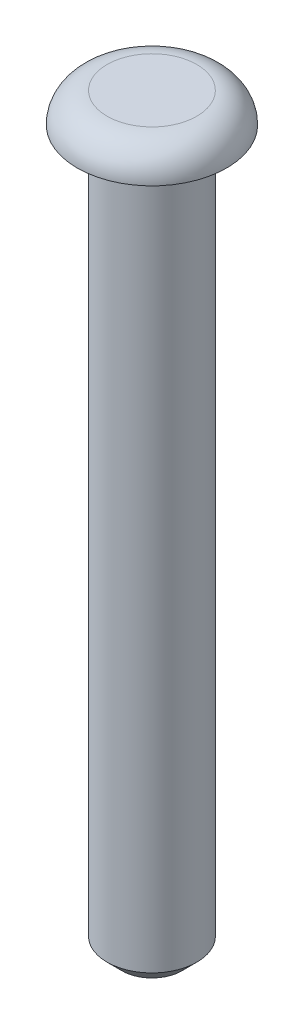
ISO-10303-21;
HEADER;
FILE_DESCRIPTION(('STEP AP214'),'2;1');
FILE_NAME('part.step','',(''),(''),'','','');
FILE_SCHEMA(('AUTOMOTIVE_DESIGN { 1 0 10303 214 1 1 1 1 }'));
ENDSEC;
DATA;
#1=APPLICATION_CONTEXT('core data for automotive mechanical design processes');
#2=APPLICATION_PROTOCOL_DEFINITION('international standard','automotive_design',2000,#1);
#3=PRODUCT_CONTEXT('',#1,'mechanical');
#4=PRODUCT('Part','Part','',(#3));
#5=PRODUCT_RELATED_PRODUCT_CATEGORY('part','',(#4));
#6=PRODUCT_DEFINITION_FORMATION('','',#4);
#7=PRODUCT_DEFINITION_CONTEXT('part definition',#1,'design');
#8=PRODUCT_DEFINITION('design','',#6,#7);
#9=PRODUCT_DEFINITION_SHAPE('','',#8);
#10=(LENGTH_UNIT() NAMED_UNIT(*) SI_UNIT(.MILLI.,.METRE.));
#11=(NAMED_UNIT(*) PLANE_ANGLE_UNIT() SI_UNIT($,.RADIAN.));
#12=(NAMED_UNIT(*) SI_UNIT($,.STERADIAN.) SOLID_ANGLE_UNIT());
#13=UNCERTAINTY_MEASURE_WITH_UNIT(LENGTH_MEASURE(1.E-05),#10,'distance_accuracy_value','');
#14=(GEOMETRIC_REPRESENTATION_CONTEXT(3) GLOBAL_UNCERTAINTY_ASSIGNED_CONTEXT((#13)) GLOBAL_UNIT_ASSIGNED_CONTEXT((#10,
#11,#12)) REPRESENTATION_CONTEXT('',''));
#15=CARTESIAN_POINT('',(0.,0.,0.));
#16=DIRECTION('',(0.,0.,1.));
#17=DIRECTION('',(1.,0.,0.));
#18=AXIS2_PLACEMENT_3D('',#15,#16,#17);
#19=CARTESIAN_POINT('',(0.,-38.1,0.));
#20=DIRECTION('',(0.,1.,0.));
#21=DIRECTION('',(0.,0.,1.));
#22=AXIS2_PLACEMENT_3D('',#19,#20,#21);
#23=CYLINDRICAL_SURFACE('',#22,2.38125);
#24=CARTESIAN_POINT('',(0.,-37.30625,0.));
#25=DIRECTION('',(0.,1.,0.));
#26=DIRECTION('',(0.,0.,1.));
#27=AXIS2_PLACEMENT_3D('',#24,#25,#26);
#28=CIRCLE('',#27,2.38125);
#29=CARTESIAN_POINT('',(0.,-37.30625,2.38125));
#30=VERTEX_POINT('',#29);
#31=EDGE_CURVE('E40',#30,#30,#28,.T.);
#32=CARTESIAN_POINT('',(0.,0.,0.));
#33=DIRECTION('',(0.,1.,0.));
#34=DIRECTION('',(0.,0.,1.));
#35=AXIS2_PLACEMENT_3D('',#32,#33,#34);
#36=CIRCLE('',#35,2.38125);
#37=CARTESIAN_POINT('',(0.,0.,2.38125));
#38=VERTEX_POINT('',#37);
#39=EDGE_CURVE('E48',#38,#38,#36,.T.);
#40=CARTESIAN_POINT('',(0.,-37.30625,2.38125));
#41=CARTESIAN_POINT('',(0.,-36.9176432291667,2.38125));
#42=CARTESIAN_POINT('',(0.,-36.5290364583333,2.38125));
#43=CARTESIAN_POINT('',(0.,-35.7518229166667,2.38125));
#44=CARTESIAN_POINT('',(0.,-35.3632161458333,2.38125));
#45=CARTESIAN_POINT('',(0.,-34.5860026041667,2.38125));
#46=CARTESIAN_POINT('',(0.,-34.1973958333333,2.38125));
#47=CARTESIAN_POINT('',(0.,-33.4201822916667,2.38125));
#48=CARTESIAN_POINT('',(0.,-33.0315755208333,2.38125));
#49=CARTESIAN_POINT('',(0.,-32.2543619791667,2.38125));
#50=CARTESIAN_POINT('',(0.,-31.8657552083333,2.38125));
#51=CARTESIAN_POINT('',(0.,-31.0885416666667,2.38125));
#52=CARTESIAN_POINT('',(0.,-30.6999348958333,2.38125));
#53=CARTESIAN_POINT('',(0.,-29.9227213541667,2.38125));
#54=CARTESIAN_POINT('',(0.,-29.5341145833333,2.38125));
#55=CARTESIAN_POINT('',(0.,-28.7569010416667,2.38125));
#56=CARTESIAN_POINT('',(0.,-28.3682942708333,2.38125));
#57=CARTESIAN_POINT('',(0.,-27.5910807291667,2.38125));
#58=CARTESIAN_POINT('',(0.,-27.2024739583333,2.38125));
#59=CARTESIAN_POINT('',(0.,-26.4252604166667,2.38125));
#60=CARTESIAN_POINT('',(0.,-26.0366536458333,2.38125));
#61=CARTESIAN_POINT('',(0.,-25.2594401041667,2.38125));
#62=CARTESIAN_POINT('',(0.,-24.8708333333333,2.38125));
#63=CARTESIAN_POINT('',(0.,-24.0936197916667,2.38125));
#64=CARTESIAN_POINT('',(0.,-23.7050130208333,2.38125));
#65=CARTESIAN_POINT('',(0.,-22.9277994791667,2.38125));
#66=CARTESIAN_POINT('',(0.,-22.5391927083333,2.38125));
#67=CARTESIAN_POINT('',(0.,-21.7619791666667,2.38125));
#68=CARTESIAN_POINT('',(0.,-21.3733723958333,2.38125));
#69=CARTESIAN_POINT('',(0.,-20.5961588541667,2.38125));
#70=CARTESIAN_POINT('',(0.,-20.2075520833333,2.38125));
#71=CARTESIAN_POINT('',(0.,-19.4303385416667,2.38125));
#72=CARTESIAN_POINT('',(0.,-19.0417317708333,2.38125));
#73=CARTESIAN_POINT('',(0.,-18.2645182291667,2.38125));
#74=CARTESIAN_POINT('',(0.,-17.8759114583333,2.38125));
#75=CARTESIAN_POINT('',(0.,-17.0986979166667,2.38125));
#76=CARTESIAN_POINT('',(0.,-16.7100911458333,2.38125));
#77=CARTESIAN_POINT('',(0.,-15.9328776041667,2.38125));
#78=CARTESIAN_POINT('',(0.,-15.5442708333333,2.38125));
#79=CARTESIAN_POINT('',(0.,-14.7670572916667,2.38125));
#80=CARTESIAN_POINT('',(0.,-14.3784505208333,2.38125));
#81=CARTESIAN_POINT('',(0.,-13.6012369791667,2.38125));
#82=CARTESIAN_POINT('',(0.,-13.2126302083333,2.38125));
#83=CARTESIAN_POINT('',(0.,-12.4354166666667,2.38125));
#84=CARTESIAN_POINT('',(0.,-12.0468098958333,2.38125));
#85=CARTESIAN_POINT('',(0.,-11.2695963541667,2.38125));
#86=CARTESIAN_POINT('',(0.,-10.8809895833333,2.38125));
#87=CARTESIAN_POINT('',(0.,-10.1037760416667,2.38125));
#88=CARTESIAN_POINT('',(0.,-9.71516927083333,2.38125));
#89=CARTESIAN_POINT('',(0.,-8.93795572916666,2.38125));
#90=CARTESIAN_POINT('',(0.,-8.54934895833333,2.38125));
#91=CARTESIAN_POINT('',(0.,-7.77213541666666,2.38125));
#92=CARTESIAN_POINT('',(0.,-7.38352864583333,2.38125));
#93=CARTESIAN_POINT('',(0.,-6.60631510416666,2.38125));
#94=CARTESIAN_POINT('',(0.,-6.21770833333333,2.38125));
#95=CARTESIAN_POINT('',(0.,-5.44049479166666,2.38125));
#96=CARTESIAN_POINT('',(0.,-5.05188802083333,2.38125));
#97=CARTESIAN_POINT('',(0.,-4.27467447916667,2.38125));
#98=CARTESIAN_POINT('',(0.,-3.88606770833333,2.38125));
#99=CARTESIAN_POINT('',(0.,-3.10885416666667,2.38125));
#100=CARTESIAN_POINT('',(0.,-2.72024739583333,2.38125));
#101=CARTESIAN_POINT('',(0.,-1.94303385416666,2.38125));
#102=CARTESIAN_POINT('',(0.,-1.55442708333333,2.38125));
#103=CARTESIAN_POINT('',(0.,-0.777213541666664,2.38125));
#104=CARTESIAN_POINT('',(0.,-0.388606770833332,2.38125));
#105=CARTESIAN_POINT('',(0.,0.,2.38125));
#106=B_SPLINE_CURVE_WITH_KNOTS('',3,(#40,#41,#42,#43,#44,#45,#46,#47,#48,#49,#50,#51,#52,#53,
#54,#55,#56,#57,#58,#59,#60,#61,#62,#63,#64,#65,#66,#67,#68,#69,#70,#71,#72,#73,#74,#75,#76,#77,
#78,#79,#80,#81,#82,#83,#84,#85,#86,#87,#88,#89,#90,#91,#92,#93,#94,#95,#96,#97,#98,#99,#100,
#101,#102,#103,#104,#105),.UNSPECIFIED.,.F.,.F.,(4,2,2,2,2,2,2,2,2,2,2,2,2,2,2,2,2,2,2,2,2,2,2,
2,2,2,2,2,2,2,2,2,4),(0.,1.1658203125,2.33164062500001,3.4974609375,4.66328125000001,
5.8291015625,6.994921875,8.1607421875,9.3265625,10.4923828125,11.658203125,12.8240234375,
13.98984375,15.1556640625,16.321484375,17.4873046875,18.653125,19.8189453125,20.984765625,
22.1505859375,23.31640625,24.4822265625,25.648046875,26.8138671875,27.9796875,29.1455078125,
30.311328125,31.4771484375,32.64296875,33.8087890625,34.974609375,36.1404296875,37.30625),.UNSPECIFIED.);
#107=EDGE_CURVE('BSEAM33',#30,#38,#106,.T.);
#108=ORIENTED_EDGE('',*,*,#31,.T.);
#109=ORIENTED_EDGE('',*,*,#39,.F.);
#110=ORIENTED_EDGE('',*,*,#107,.T.);
#111=ORIENTED_EDGE('',*,*,#107,.F.);
#112=EDGE_LOOP('',(#108,#110,#109,#111));
#113=FACE_BOUND('',#112,.T.);
#114=ADVANCED_FACE('F33',(#113),#23,.T.);
#115=CARTESIAN_POINT('',(0.,-38.1,0.));
#116=DIRECTION('',(0.,1.,0.));
#117=DIRECTION('',(0.,0.,1.));
#118=AXIS2_PLACEMENT_3D('',#115,#116,#117);
#119=PLANE('',#118);
#120=CARTESIAN_POINT('',(0.,-38.1,0.));
#121=DIRECTION('',(0.,1.,0.));
#122=DIRECTION('',(0.,0.,1.));
#123=AXIS2_PLACEMENT_3D('',#120,#121,#122);
#124=CIRCLE('',#123,1.58749999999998);
#125=CARTESIAN_POINT('',(0.,-38.1,1.58749999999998));
#126=VERTEX_POINT('',#125);
#127=EDGE_CURVE('E10',#126,#126,#124,.F.);
#128=ORIENTED_EDGE('',*,*,#127,.T.);
#129=EDGE_LOOP('',(#128));
#130=FACE_BOUND('',#129,.T.);
#131=ADVANCED_FACE('F69',(#130),#119,.F.);
#132=CARTESIAN_POINT('',(0.,1.5875,0.));
#133=DIRECTION('',(0.,1.,0.));
#134=DIRECTION('',(0.,0.,1.));
#135=AXIS2_PLACEMENT_3D('',#132,#133,#134);
#136=PLANE('',#135);
#137=CARTESIAN_POINT('',(0.,1.5875,0.));
#138=DIRECTION('',(0.,1.,0.));
#139=DIRECTION('',(0.,0.,1.));
#140=AXIS2_PLACEMENT_3D('',#137,#138,#139);
#141=CIRCLE('',#140,2.38125);
#142=CARTESIAN_POINT('',(0.,1.5875,2.38125));
#143=VERTEX_POINT('',#142);
#144=EDGE_CURVE('E44',#143,#143,#141,.T.);
#145=ORIENTED_EDGE('',*,*,#144,.T.);
#146=EDGE_LOOP('',(#145));
#147=FACE_BOUND('',#146,.T.);
#148=ADVANCED_FACE('F62',(#147),#136,.T.);
#149=CARTESIAN_POINT('',(0.,0.,0.));
#150=DIRECTION('',(0.,1.,0.));
#151=DIRECTION('',(0.,0.,1.));
#152=AXIS2_PLACEMENT_3D('',#149,#150,#151);
#153=PLANE('',#152);
#154=ORIENTED_EDGE('',*,*,#39,.T.);
#155=EDGE_LOOP('',(#154));
#156=FACE_BOUND('',#155,.T.);
#157=CARTESIAN_POINT('',(0.,0.,0.));
#158=DIRECTION('',(0.,1.,0.));
#159=DIRECTION('',(0.,0.,1.));
#160=AXIS2_PLACEMENT_3D('',#157,#158,#159);
#161=CIRCLE('',#160,3.96875);
#162=CARTESIAN_POINT('',(0.,0.,3.96875));
#163=VERTEX_POINT('',#162);
#164=EDGE_CURVE('E53',#163,#163,#161,.T.);
#165=ORIENTED_EDGE('',*,*,#164,.F.);
#166=EDGE_LOOP('',(#165));
#167=FACE_BOUND('',#166,.T.);
#168=ADVANCED_FACE('F60',(#156,#167),#153,.F.);
#169=CARTESIAN_POINT('',(0.,0.,0.));
#170=DIRECTION('',(0.,1.,0.));
#171=DIRECTION('',(0.,0.,1.));
#172=AXIS2_PLACEMENT_3D('',#169,#170,#171);
#173=TOROIDAL_SURFACE('',#172,2.38125,1.5875);
#174=ORIENTED_EDGE('',*,*,#164,.T.);
#175=EDGE_LOOP('',(#174));
#176=FACE_BOUND('',#175,.T.);
#177=ORIENTED_EDGE('',*,*,#144,.F.);
#178=EDGE_LOOP('',(#177));
#179=FACE_BOUND('',#178,.T.);
#180=ADVANCED_FACE('F57',(#176,#179),#173,.T.);
#181=CARTESIAN_POINT('',(0.,-37.30625,0.));
#182=DIRECTION('',(0.,1.,0.));
#183=DIRECTION('',(0.,0.,1.));
#184=AXIS2_PLACEMENT_3D('',#181,#182,#183);
#185=CONICAL_SURFACE('',#184,2.38125,0.785398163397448);
#186=ORIENTED_EDGE('',*,*,#127,.F.);
#187=EDGE_LOOP('',(#186));
#188=FACE_BOUND('',#187,.T.);
#189=ORIENTED_EDGE('',*,*,#31,.F.);
#190=EDGE_LOOP('',(#189));
#191=FACE_BOUND('',#190,.T.);
#192=ADVANCED_FACE('F35',(#188,#191),#185,.T.);
#193=CLOSED_SHELL('',(#114,#131,#148,#168,#180,#192));
#194=MANIFOLD_SOLID_BREP('B2',#193);
#195=ADVANCED_BREP_SHAPE_REPRESENTATION('',(#18,#194),#14);
#196=SHAPE_DEFINITION_REPRESENTATION(#9,#195);
ENDSEC;
END-ISO-10303-21;
